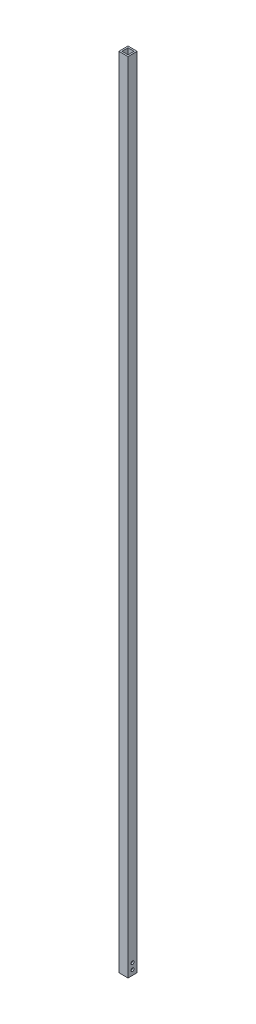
from build123d import *

# Parameters (mm, degrees)
SKETCH3_W                    = 9.525
SKETCH3_H                    = 9.525
SKETCH3_W_2                  = 6.35
SKETCH3_H_2                  = 6.35
BOSS_EXTRUDE1_DEPTH          = 828.802
F_1_8_0_125_DIAMETER_HOLE1_D = 3.175


with BuildPart() as part:
    # Sketch3 → Boss-Extrude1 (new body)
    with BuildSketch(Plane(origin=(0, 0, 0), x_dir=(1, 0, 0), z_dir=(0, 1, 0))):
        Rectangle(SKETCH3_W, SKETCH3_H)
        Rectangle(SKETCH3_W_2, SKETCH3_H_2, mode=Mode.SUBTRACT)
    extrude(amount=BOSS_EXTRUDE1_DEPTH)

    # 1_8 _0.125_ Diameter Hole1 (through all)
    with Locations(Plane.ZY.offset(4.7625)):
        with Locations((0, 5.08), (0, 11.43)):
            Hole(F_1_8_0_125_DIAMETER_HOLE1_D / 2)


solid = part.part
